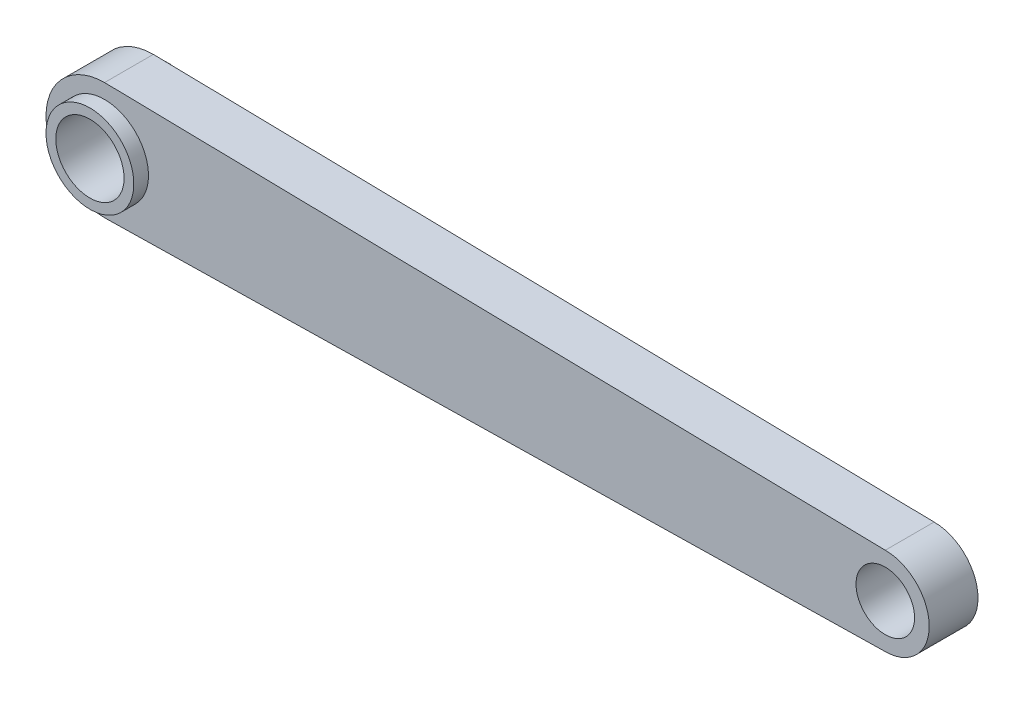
from build123d import *

# Parameters (mm, degrees)
BASE_EXTRUDE_DEPTH       = 6.35
BASE_EXTRUDE_DEPTH_BACK  = 6.35
BOSS_EXTRUDE1_DEPTH      = 10.16
BOSS_EXTRUDE1_DEPTH_BACK = 10.16
SKETCH2_R                = 11.43
CUT_EXTRUDE1_DEPTH       = 216.4101207
CUT_EXTRUDE1_DEPTH_BACK  = 216.4101207
SKETCH3_R                = 8.89
CUT_EXTRUDE2_DEPTH       = 216.4101207
CUT_EXTRUDE2_DEPTH_BACK  = 216.4101207
SKETCH4_R                = 7.62


with BuildPart() as part:
    # Sketch1 → Base-Extrude (new, two sides: drawn at the far end of the back side and taken through both)
    with BuildSketch(Plane.XY.offset(-BASE_EXTRUDE_DEPTH_BACK)):
        with BuildLine():
            Line((0, 15.24), (203.2, 11.43))
            ThreePointArc((203.2, 11.43), (214.63, 0), (203.2, -11.43))
            Line((203.2, -11.43), (0, -15.24))
            ThreePointArc((0, -15.24), (-15.24, 0), (0, 15.24))
        make_face()
    extrude(amount=BASE_EXTRUDE_DEPTH + BASE_EXTRUDE_DEPTH_BACK)

    # Sketch2 → Boss-Extrude1 (add, two sides: drawn at the far end of the back side and taken through both)
    with BuildSketch(Plane.XY.offset(-BOSS_EXTRUDE1_DEPTH_BACK)):
        with Locations(Location((0, 0, 0), (0, 0, 180))):
            Circle(SKETCH2_R)
    extrude(amount=BOSS_EXTRUDE1_DEPTH + BOSS_EXTRUDE1_DEPTH_BACK)

    # Sketch3 → Cut-Extrude1 (cut, two sides: drawn at the far end of the back side and taken through both)
    with BuildSketch(Plane.XY.offset(-CUT_EXTRUDE1_DEPTH_BACK)):
        Circle(SKETCH3_R)
    extrude(amount=CUT_EXTRUDE1_DEPTH + CUT_EXTRUDE1_DEPTH_BACK, mode=Mode.SUBTRACT)

    # Sketch4 → Cut-Extrude2 (cut, two sides: drawn at the far end of the back side and taken through both)
    with BuildSketch(Plane.XY.offset(-CUT_EXTRUDE2_DEPTH_BACK)):
        with Locations((203.2, 0)):
            Circle(SKETCH4_R)
    extrude(amount=CUT_EXTRUDE2_DEPTH + CUT_EXTRUDE2_DEPTH_BACK, mode=Mode.SUBTRACT)


solid = part.part
